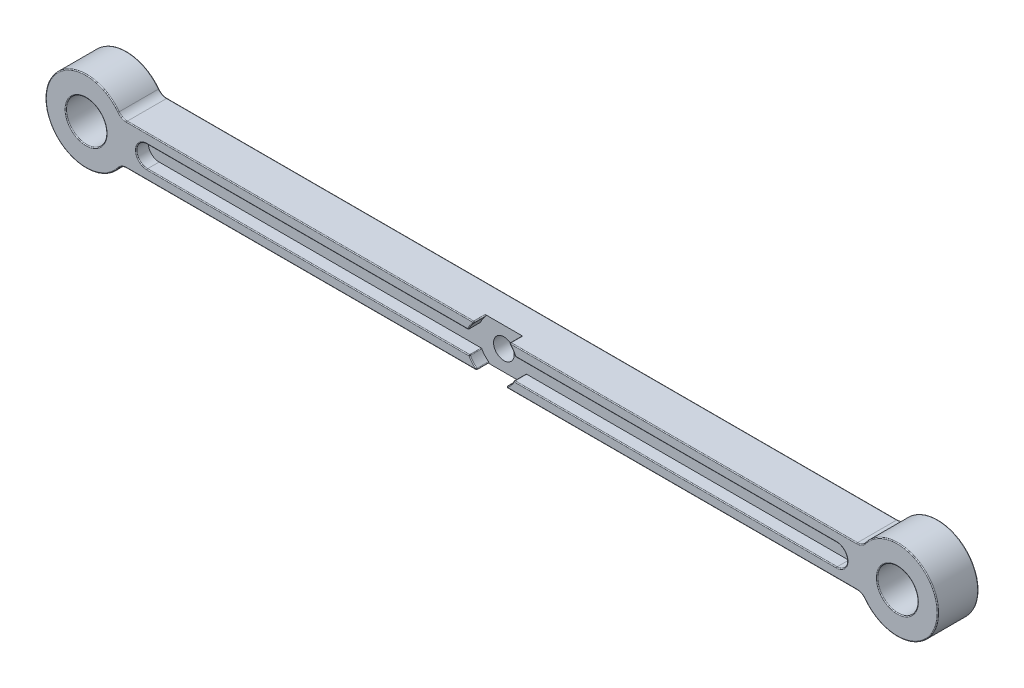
from build123d import *

# Parameters (mm, degrees)
SKETCH1_R           = 6.35
BOSS_EXTRUDE1_DEPTH = 6.35
CUT_EXTRUDE1_DEPTH  = 3.81
SKETCH4_R           = 7.9375
CUT_EXTRUDE5_DEPTH  = 3.81
FILLET2_R           = 3.175
SKETCH5_R           = 3.2385
CUT_EXTRUDE6_DEPTH  = 141.557504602
FILLET1_R           = 0.254


with BuildPart() as part:
    # Sketch1 → Boss-Extrude1 (new, symmetric)
    with BuildSketch(Plane.XY):
        with BuildLine():
            Line((-116.001477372, 6.35), (116.001477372, 6.35))
            ThreePointArc((116.001477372, 6.35), (139.7, 0), (116.001477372, -6.35))
            Line((116.001477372, -6.35), (-116.001477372, -6.35))
            ThreePointArc((-116.001477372, -6.35), (-139.7, 0), (-116.001477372, 6.35))
        make_face()
        with Locations((-127, 0)):
            Circle(SKETCH1_R, mode=Mode.SUBTRACT)
        with Locations((127, 0)):
            Circle(SKETCH1_R, mode=Mode.SUBTRACT)
    extrude(amount=BOSS_EXTRUDE1_DEPTH, both=True)

    # Sketch2 → Cut-Extrude1 (cut)
    with BuildSketch(Plane.XY.offset(6.35)):
        with BuildLine():
            Line((-107.95, -3.3655), (107.95, -3.3655))
            ThreePointArc((107.95, -3.3655), (111.3155, 0), (107.95, 3.3655))
            Line((107.95, 3.3655), (-107.95, 3.3655))
            ThreePointArc((-107.95, 3.3655), (-111.3155, 0), (-107.95, -3.3655))
        make_face()
    cut_extrude1 = extrude(amount=-CUT_EXTRUDE1_DEPTH, mode=Mode.SUBTRACT)

    # Sketch4 → Cut-Extrude5 (cut)
    with BuildSketch(Plane.XY.offset(6.35)):
        with Locations((0, 0.407221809)):
            Circle(SKETCH4_R)
    extrude(amount=-CUT_EXTRUDE5_DEPTH, mode=Mode.SUBTRACT)

    # Mirror1: Cut-Extrude1 across plane
    add(cut_extrude1.mirror(Plane.XY), mode=Mode.SUBTRACT)

    # Fillet2
    fillet2_edges = [part.edges().sort_by_distance(p)[0] for p in [
        (-116.001477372, 6.35, 0),
        (116.001477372, 6.35, 0),
        (116.001477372, -6.35, 0),
        (-116.001477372, -6.35, 0),
    ]]
    fillet(fillet2_edges, radius=FILLET2_R)

    # Sketch5 → Cut-Extrude6 (cut, through all)
    with BuildSketch(Plane.XY.offset(2.54)):
        Circle(SKETCH5_R)
    extrude(amount=-CUT_EXTRUDE6_DEPTH, mode=Mode.SUBTRACT)

    # Fillet1
    fillet1_edges = [part.edges().sort_by_distance(p)[0] for p in [
        (-133.35, 0, -6.35),
        (-133.35, 0, 6.35),
        (120.65, 0, -6.35),
        (120.65, 0, 6.35),
        (-111.3155, 0, 6.35),
        (-57.466793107, -3.3655, 6.35),
        (111.3155, 0, 6.35),
        (57.657814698, 3.3655, 6.35),
        (57.466793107, -3.3655, 6.35),
        (-57.657814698, 3.3655, 6.35),
        (-59.780935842, 6.35, 6.35),
        (59.23229799, -6.35, 6.35),
        (-5.77038141, -5.04315475, 6.35),
        (5.77038141, -5.04315475, 6.35),
        (6.487700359, 4.980366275, 6.35),
        (-6.487700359, 4.980366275, 6.35),
        (-4.164595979, -6.35, 4.445),
        (-6.983586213, -3.3655, 4.445),
        (4.164595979, -6.35, 4.445),
        (6.983586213, -3.3655, 4.445),
        (5.261871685, 6.35, 4.445),
        (7.365629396, 3.3655, 4.445),
        (-5.261871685, 6.35, 4.445),
        (-7.365629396, 3.3655, 4.445),
        (-111.3155, 0, -6.35),
        (0, -3.3655, -6.35),
        (111.3155, 0, -6.35),
        (0, 3.3655, -6.35),
        (59.780935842, 6.35, 6.35),
        (0, 6.35, -6.35),
        (139.7, 0, -6.35),
        (139.7, 0, 6.35),
        (-59.23229799, -6.35, 6.35),
        (0, -6.35, -6.35),
        (-139.7, 0, -6.35),
        (-139.7, 0, 6.35),
        (115.719903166, 6.685193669, -6.35),
        (115.719903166, 6.685193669, 6.35),
        (115.719903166, -6.685193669, -6.35),
        (115.719903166, -6.685193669, 6.35),
        (-115.719903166, -6.685193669, -6.35),
        (-115.719903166, -6.685193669, 6.35),
        (-115.719903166, 6.685193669, -6.35),
        (-115.719903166, 6.685193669, 6.35),
    ]]
    fillet(fillet1_edges, radius=FILLET1_R)


solid = part.part
